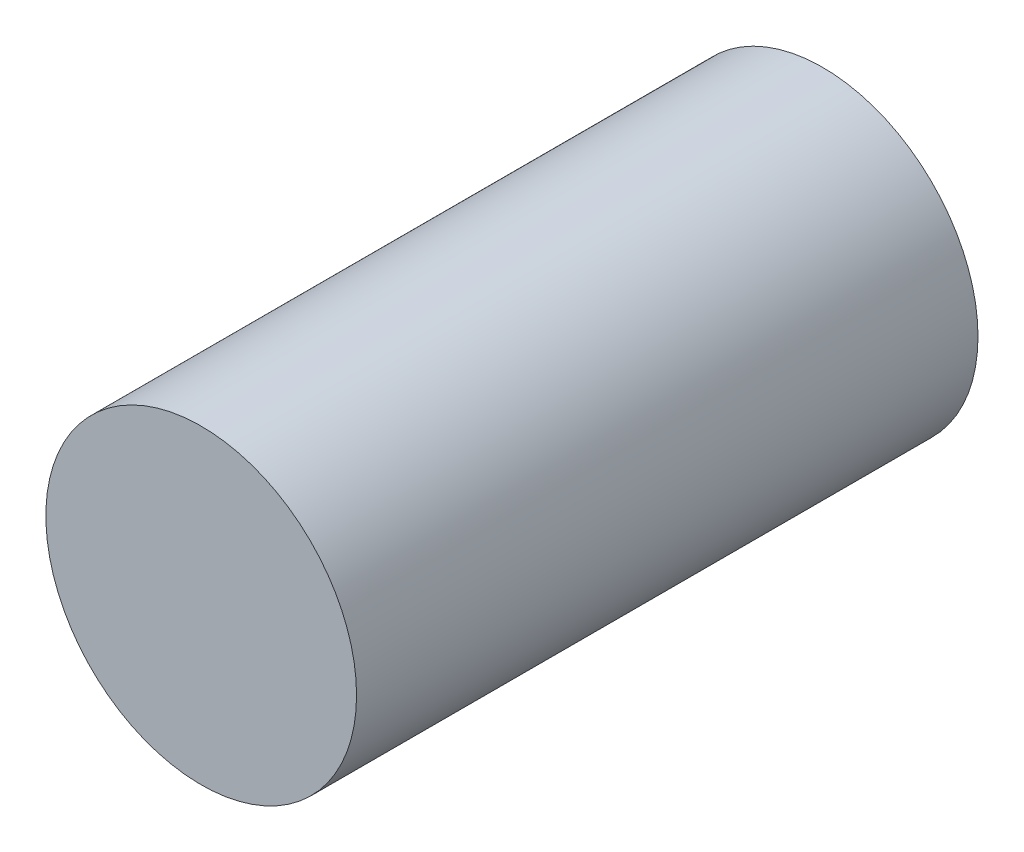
from build123d import *

# Parameters (mm, degrees)
SKETCH1_R           = 7.5
BOSS_EXTRUDE1_DEPTH = 15


with BuildPart() as part:
    # Sketch1 → Boss-Extrude1 (new, symmetric)
    with BuildSketch(Plane.XY):
        Circle(SKETCH1_R)
    extrude(amount=BOSS_EXTRUDE1_DEPTH, both=True)


solid = part.part
